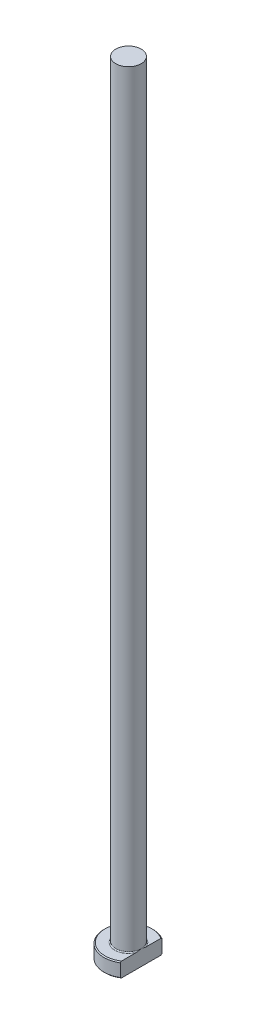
from build123d import *
from build123d.topology import SkipClean

# Parameters (mm, degrees)
CHAMFER1_SIZE = 0.2
FILLET1_R     = 0.2
KEY_DEPTH     = 161.15617378


with BuildPart() as part:
    # Sketch1 → Revolve1 (revolve)
    with BuildSketch(Plane.XY, mode=Mode.PRIVATE) as revolve1_sk:
        Polygon((0, 0), (-5, 0), (-5, 3), (-2.6, 3), (-2.6, 160), (0, 160), align=None)
    revolve(revolve1_sk.sketch.rotate(Axis((0, 259.958771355, 0), (0, -1, 0)), 270), axis=Axis((0, 259.958771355, 0), (0, -1, 0)))

    # Chamfer1
    chamfer1_edges = [part.edges().sort_by_distance(p)[0] for p in [
        (0, 3, -5),
        (0, 0, -5),
    ]]
    chamfer(chamfer1_edges, length=CHAMFER1_SIZE)

    # Fillet1
    fillet1_edges = [part.edges().sort_by_distance(p)[0] for p in [
        (0, 3, -2.6),
    ]]
    fillet(fillet1_edges, radius=FILLET1_R)

    # Sketch2 → KEY (cut, through all)
    with SkipClean():  # the faces are left unmerged after this step: merging them gives an invalid solid
        with BuildSketch(Plane(origin=(0, 0, 0), x_dir=(1, 0, 0), z_dir=(0, 1, 0))):
            with BuildLine():
                Line((2.6, 4.270831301), (2.6, -4.270831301))
                ThreePointArc((2.6, -4.270831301), (5, 0), (2.6, 4.270831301))
            make_face()
        extrude(amount=KEY_DEPTH, mode=Mode.SUBTRACT)


solid = part.part
